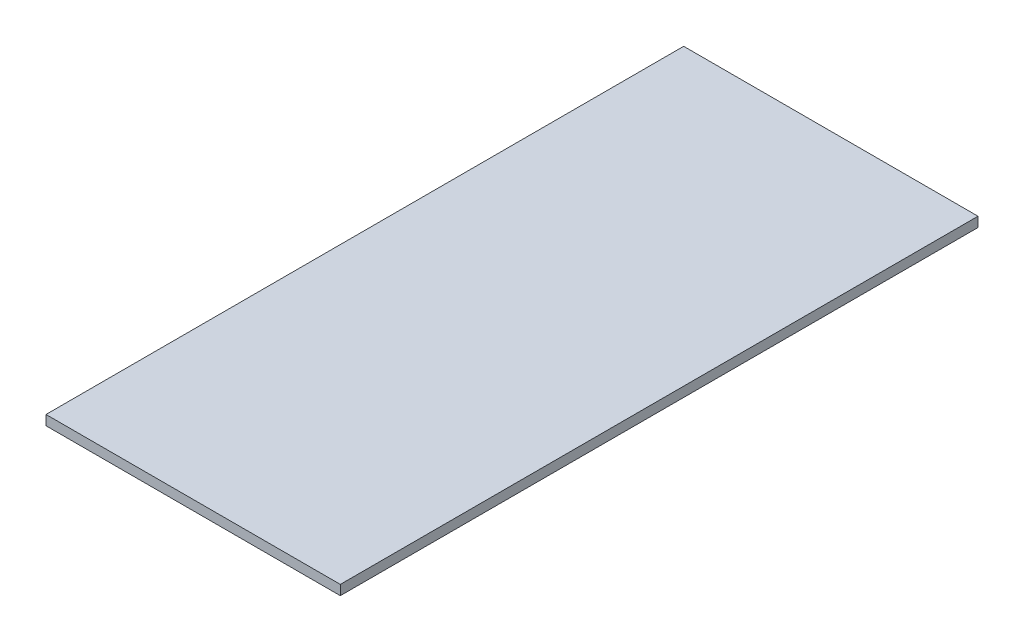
ISO-10303-21;
HEADER;
FILE_DESCRIPTION(('STEP AP214'),'2;1');
FILE_NAME('part.step','',(''),(''),'','','');
FILE_SCHEMA(('AUTOMOTIVE_DESIGN { 1 0 10303 214 1 1 1 1 }'));
ENDSEC;
DATA;
#1=APPLICATION_CONTEXT('core data for automotive mechanical design processes');
#2=APPLICATION_PROTOCOL_DEFINITION('international standard','automotive_design',2000,#1);
#3=PRODUCT_CONTEXT('',#1,'mechanical');
#4=PRODUCT('Part','Part','',(#3));
#5=PRODUCT_RELATED_PRODUCT_CATEGORY('part','',(#4));
#6=PRODUCT_DEFINITION_FORMATION('','',#4);
#7=PRODUCT_DEFINITION_CONTEXT('part definition',#1,'design');
#8=PRODUCT_DEFINITION('design','',#6,#7);
#9=PRODUCT_DEFINITION_SHAPE('','',#8);
#10=(LENGTH_UNIT() NAMED_UNIT(*) SI_UNIT(.MILLI.,.METRE.));
#11=(NAMED_UNIT(*) PLANE_ANGLE_UNIT() SI_UNIT($,.RADIAN.));
#12=(NAMED_UNIT(*) SI_UNIT($,.STERADIAN.) SOLID_ANGLE_UNIT());
#13=UNCERTAINTY_MEASURE_WITH_UNIT(LENGTH_MEASURE(1.E-05),#10,'distance_accuracy_value','');
#14=(GEOMETRIC_REPRESENTATION_CONTEXT(3) GLOBAL_UNCERTAINTY_ASSIGNED_CONTEXT((#13)) GLOBAL_UNIT_ASSIGNED_CONTEXT((#10,
#11,#12)) REPRESENTATION_CONTEXT('',''));
#15=CARTESIAN_POINT('',(0.,0.,0.));
#16=DIRECTION('',(0.,0.,1.));
#17=DIRECTION('',(1.,0.,0.));
#18=AXIS2_PLACEMENT_3D('',#15,#16,#17);
#19=CARTESIAN_POINT('',(0.,1.,0.));
#20=DIRECTION('',(1.,0.,0.));
#21=DIRECTION('',(0.,0.,-1.));
#22=AXIS2_PLACEMENT_3D('',#19,#20,#21);
#23=PLANE('',#22);
#24=DIRECTION('',(0.,0.,1.));
#25=VECTOR('',#24,1.);
#26=CARTESIAN_POINT('',(0.,0.,0.));
#27=LINE('',#26,#25);
#28=CARTESIAN_POINT('',(0.,0.,-65.));
#29=VERTEX_POINT('',#28);
#30=CARTESIAN_POINT('',(0.,0.,0.));
#31=VERTEX_POINT('',#30);
#32=EDGE_CURVE('E96',#29,#31,#27,.T.);
#33=ORIENTED_EDGE('',*,*,#32,.T.);
#34=DIRECTION('',(0.,-1.,0.));
#35=VECTOR('',#34,1.);
#36=CARTESIAN_POINT('',(0.,1.,0.));
#37=LINE('',#36,#35);
#38=CARTESIAN_POINT('',(0.,1.,0.));
#39=VERTEX_POINT('',#38);
#40=EDGE_CURVE('E11',#39,#31,#37,.T.);
#41=ORIENTED_EDGE('',*,*,#40,.F.);
#42=DIRECTION('',(0.,0.,1.));
#43=VECTOR('',#42,1.);
#44=CARTESIAN_POINT('',(0.,1.,0.));
#45=LINE('',#44,#43);
#46=CARTESIAN_POINT('',(0.,1.,-65.));
#47=VERTEX_POINT('',#46);
#48=EDGE_CURVE('E84',#47,#39,#45,.T.);
#49=ORIENTED_EDGE('',*,*,#48,.F.);
#50=DIRECTION('',(0.,-1.,0.));
#51=VECTOR('',#50,1.);
#52=CARTESIAN_POINT('',(0.,1.,-65.));
#53=LINE('',#52,#51);
#54=EDGE_CURVE('E92',#47,#29,#53,.T.);
#55=ORIENTED_EDGE('',*,*,#54,.T.);
#56=EDGE_LOOP('',(#33,#41,#49,#55));
#57=FACE_BOUND('',#56,.T.);
#58=ADVANCED_FACE('F33',(#57),#23,.F.);
#59=CARTESIAN_POINT('',(0.,1.,0.));
#60=DIRECTION('',(0.,0.,-1.));
#61=DIRECTION('',(-1.,0.,0.));
#62=AXIS2_PLACEMENT_3D('',#59,#60,#61);
#63=PLANE('',#62);
#64=DIRECTION('',(1.,0.,0.));
#65=VECTOR('',#64,1.);
#66=CARTESIAN_POINT('',(0.,0.,0.));
#67=LINE('',#66,#65);
#68=CARTESIAN_POINT('',(30.,0.,0.));
#69=VERTEX_POINT('',#68);
#70=EDGE_CURVE('E88',#31,#69,#67,.T.);
#71=ORIENTED_EDGE('',*,*,#70,.T.);
#72=DIRECTION('',(0.,-1.,0.));
#73=VECTOR('',#72,1.);
#74=CARTESIAN_POINT('',(30.,1.,0.));
#75=LINE('',#74,#73);
#76=CARTESIAN_POINT('',(30.,1.,0.));
#77=VERTEX_POINT('',#76);
#78=EDGE_CURVE('E41',#77,#69,#75,.T.);
#79=ORIENTED_EDGE('',*,*,#78,.F.);
#80=DIRECTION('',(1.,0.,0.));
#81=VECTOR('',#80,1.);
#82=CARTESIAN_POINT('',(0.,1.,0.));
#83=LINE('',#82,#81);
#84=EDGE_CURVE('E79',#39,#77,#83,.T.);
#85=ORIENTED_EDGE('',*,*,#84,.F.);
#86=ORIENTED_EDGE('',*,*,#40,.T.);
#87=EDGE_LOOP('',(#71,#79,#85,#86));
#88=FACE_BOUND('',#87,.T.);
#89=ADVANCED_FACE('F87',(#88),#63,.F.);
#90=CARTESIAN_POINT('',(30.,1.,0.));
#91=DIRECTION('',(-1.,0.,0.));
#92=DIRECTION('',(0.,0.,1.));
#93=AXIS2_PLACEMENT_3D('',#90,#91,#92);
#94=PLANE('',#93);
#95=DIRECTION('',(0.,0.,-1.));
#96=VECTOR('',#95,1.);
#97=CARTESIAN_POINT('',(30.,0.,0.));
#98=LINE('',#97,#96);
#99=CARTESIAN_POINT('',(30.,0.,-65.));
#100=VERTEX_POINT('',#99);
#101=EDGE_CURVE('E66',#69,#100,#98,.T.);
#102=ORIENTED_EDGE('',*,*,#101,.T.);
#103=DIRECTION('',(0.,-1.,0.));
#104=VECTOR('',#103,1.);
#105=CARTESIAN_POINT('',(30.,1.,-65.));
#106=LINE('',#105,#104);
#107=CARTESIAN_POINT('',(30.,1.,-65.));
#108=VERTEX_POINT('',#107);
#109=EDGE_CURVE('E89',#108,#100,#106,.T.);
#110=ORIENTED_EDGE('',*,*,#109,.F.);
#111=DIRECTION('',(0.,0.,-1.));
#112=VECTOR('',#111,1.);
#113=CARTESIAN_POINT('',(30.,1.,0.));
#114=LINE('',#113,#112);
#115=EDGE_CURVE('E82',#77,#108,#114,.T.);
#116=ORIENTED_EDGE('',*,*,#115,.F.);
#117=ORIENTED_EDGE('',*,*,#78,.T.);
#118=EDGE_LOOP('',(#102,#110,#116,#117));
#119=FACE_BOUND('',#118,.T.);
#120=ADVANCED_FACE('F90',(#119),#94,.F.);
#121=CARTESIAN_POINT('',(0.,1.,-65.));
#122=DIRECTION('',(0.,0.,1.));
#123=DIRECTION('',(1.,0.,0.));
#124=AXIS2_PLACEMENT_3D('',#121,#122,#123);
#125=PLANE('',#124);
#126=DIRECTION('',(-1.,0.,0.));
#127=VECTOR('',#126,1.);
#128=CARTESIAN_POINT('',(0.,0.,-65.));
#129=LINE('',#128,#127);
#130=EDGE_CURVE('E72',#100,#29,#129,.T.);
#131=ORIENTED_EDGE('',*,*,#130,.T.);
#132=ORIENTED_EDGE('',*,*,#54,.F.);
#133=DIRECTION('',(-1.,0.,0.));
#134=VECTOR('',#133,1.);
#135=CARTESIAN_POINT('',(0.,1.,-65.));
#136=LINE('',#135,#134);
#137=EDGE_CURVE('E49',#108,#47,#136,.T.);
#138=ORIENTED_EDGE('',*,*,#137,.F.);
#139=ORIENTED_EDGE('',*,*,#109,.T.);
#140=EDGE_LOOP('',(#131,#132,#138,#139));
#141=FACE_BOUND('',#140,.T.);
#142=ADVANCED_FACE('F103',(#141),#125,.F.);
#143=CARTESIAN_POINT('',(0.,1.,0.));
#144=DIRECTION('',(0.,-1.,0.));
#145=DIRECTION('',(0.,0.,-1.));
#146=AXIS2_PLACEMENT_3D('',#143,#144,#145);
#147=PLANE('',#146);
#148=ORIENTED_EDGE('',*,*,#48,.T.);
#149=ORIENTED_EDGE('',*,*,#84,.T.);
#150=ORIENTED_EDGE('',*,*,#115,.T.);
#151=ORIENTED_EDGE('',*,*,#137,.T.);
#152=EDGE_LOOP('',(#148,#149,#150,#151));
#153=FACE_BOUND('',#152,.T.);
#154=ADVANCED_FACE('F80',(#153),#147,.F.);
#155=CARTESIAN_POINT('',(0.,0.,0.));
#156=DIRECTION('',(0.,-1.,0.));
#157=DIRECTION('',(0.,0.,-1.));
#158=AXIS2_PLACEMENT_3D('',#155,#156,#157);
#159=PLANE('',#158);
#160=ORIENTED_EDGE('',*,*,#32,.F.);
#161=ORIENTED_EDGE('',*,*,#130,.F.);
#162=ORIENTED_EDGE('',*,*,#101,.F.);
#163=ORIENTED_EDGE('',*,*,#70,.F.);
#164=EDGE_LOOP('',(#160,#161,#162,#163));
#165=FACE_BOUND('',#164,.T.);
#166=ADVANCED_FACE('F106',(#165),#159,.T.);
#167=CLOSED_SHELL('',(#58,#89,#120,#142,#154,#166));
#168=MANIFOLD_SOLID_BREP('B2',#167);
#169=ADVANCED_BREP_SHAPE_REPRESENTATION('',(#18,#168),#14);
#170=SHAPE_DEFINITION_REPRESENTATION(#9,#169);
ENDSEC;
END-ISO-10303-21;
